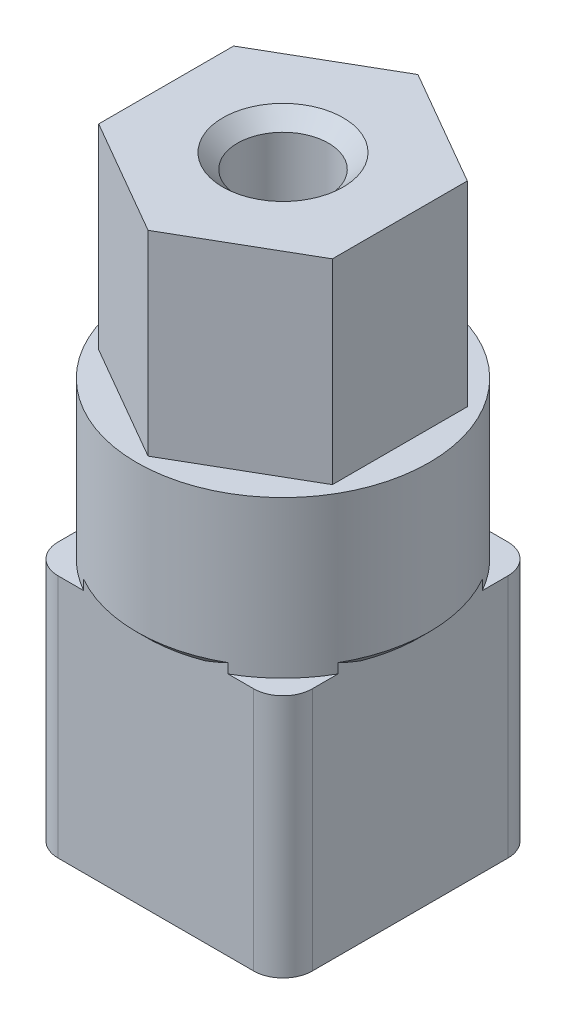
ISO-10303-21;
HEADER;
FILE_DESCRIPTION(('STEP AP214'),'2;1');
FILE_NAME('part.step','',(''),(''),'','','');
FILE_SCHEMA(('AUTOMOTIVE_DESIGN { 1 0 10303 214 1 1 1 1 }'));
ENDSEC;
DATA;
#1=APPLICATION_CONTEXT('core data for automotive mechanical design processes');
#2=APPLICATION_PROTOCOL_DEFINITION('international standard','automotive_design',2000,#1);
#3=PRODUCT_CONTEXT('',#1,'mechanical');
#4=PRODUCT('Part','Part','',(#3));
#5=PRODUCT_RELATED_PRODUCT_CATEGORY('part','',(#4));
#6=PRODUCT_DEFINITION_FORMATION('','',#4);
#7=PRODUCT_DEFINITION_CONTEXT('part definition',#1,'design');
#8=PRODUCT_DEFINITION('design','',#6,#7);
#9=PRODUCT_DEFINITION_SHAPE('','',#8);
#10=(LENGTH_UNIT() NAMED_UNIT(*) SI_UNIT(.MILLI.,.METRE.));
#11=(NAMED_UNIT(*) PLANE_ANGLE_UNIT() SI_UNIT($,.RADIAN.));
#12=(NAMED_UNIT(*) SI_UNIT($,.STERADIAN.) SOLID_ANGLE_UNIT());
#13=UNCERTAINTY_MEASURE_WITH_UNIT(LENGTH_MEASURE(1.E-05),#10,'distance_accuracy_value','');
#14=(GEOMETRIC_REPRESENTATION_CONTEXT(3) GLOBAL_UNCERTAINTY_ASSIGNED_CONTEXT((#13)) GLOBAL_UNIT_ASSIGNED_CONTEXT((#10,
#11,#12)) REPRESENTATION_CONTEXT('',''));
#15=CARTESIAN_POINT('',(0.,0.,0.));
#16=DIRECTION('',(0.,0.,1.));
#17=DIRECTION('',(1.,0.,0.));
#18=AXIS2_PLACEMENT_3D('',#15,#16,#17);
#19=CARTESIAN_POINT('',(0.,41.,0.));
#20=DIRECTION('',(0.,1.,0.));
#21=DIRECTION('',(0.,0.,1.));
#22=AXIS2_PLACEMENT_3D('',#19,#20,#21);
#23=PLANE('',#22);
#24=CARTESIAN_POINT('',(0.,41.,0.));
#25=DIRECTION('',(0.,1.,0.));
#26=DIRECTION('',(0.,0.,1.));
#27=AXIS2_PLACEMENT_3D('',#24,#25,#26);
#28=CIRCLE('',#27,14.95);
#29=CARTESIAN_POINT('',(0.,41.,14.95));
#30=VERTEX_POINT('',#29);
#31=EDGE_CURVE('E250',#30,#30,#28,.T.);
#32=ORIENTED_EDGE('',*,*,#31,.T.);
#33=EDGE_LOOP('',(#32));
#34=FACE_BOUND('',#33,.T.);
#35=DIRECTION('',(-0.866025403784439,0.,0.5));
#36=VECTOR('',#35,1.);
#37=CARTESIAN_POINT('',(0.,41.,-13.7986714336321));
#38=LINE('',#37,#36);
#39=CARTESIAN_POINT('',(0.,41.,-13.7986714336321));
#40=VERTEX_POINT('',#39);
#41=CARTESIAN_POINT('',(-11.95,41.,-6.89933571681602));
#42=VERTEX_POINT('',#41);
#43=EDGE_CURVE('E654',#40,#42,#38,.T.);
#44=ORIENTED_EDGE('',*,*,#43,.F.);
#45=DIRECTION('',(-0.866025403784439,0.,-0.5));
#46=VECTOR('',#45,1.);
#47=CARTESIAN_POINT('',(11.95,41.,-6.89933571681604));
#48=LINE('',#47,#46);
#49=CARTESIAN_POINT('',(11.95,41.,-6.89933571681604));
#50=VERTEX_POINT('',#49);
#51=EDGE_CURVE('E242',#50,#40,#48,.T.);
#52=ORIENTED_EDGE('',*,*,#51,.F.);
#53=DIRECTION('',(0.,0.,-1.));
#54=VECTOR('',#53,1.);
#55=CARTESIAN_POINT('',(11.95,41.,6.89933571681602));
#56=LINE('',#55,#54);
#57=CARTESIAN_POINT('',(11.95,41.,6.89933571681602));
#58=VERTEX_POINT('',#57);
#59=EDGE_CURVE('E238',#58,#50,#56,.T.);
#60=ORIENTED_EDGE('',*,*,#59,.F.);
#61=DIRECTION('',(0.866025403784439,0.,-0.5));
#62=VECTOR('',#61,1.);
#63=CARTESIAN_POINT('',(0.,41.,13.798671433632));
#64=LINE('',#63,#62);
#65=CARTESIAN_POINT('',(0.,41.,13.798671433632));
#66=VERTEX_POINT('',#65);
#67=EDGE_CURVE('E638',#66,#58,#64,.T.);
#68=ORIENTED_EDGE('',*,*,#67,.F.);
#69=DIRECTION('',(0.866025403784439,0.,0.5));
#70=VECTOR('',#69,1.);
#71=CARTESIAN_POINT('',(-11.95,41.,6.89933571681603));
#72=LINE('',#71,#70);
#73=CARTESIAN_POINT('',(-11.95,41.,6.89933571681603));
#74=VERTEX_POINT('',#73);
#75=EDGE_CURVE('E636',#74,#66,#72,.T.);
#76=ORIENTED_EDGE('',*,*,#75,.F.);
#77=DIRECTION('',(0.,0.,1.));
#78=VECTOR('',#77,1.);
#79=CARTESIAN_POINT('',(-11.95,41.,-6.89933571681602));
#80=LINE('',#79,#78);
#81=EDGE_CURVE('E639',#42,#74,#80,.T.);
#82=ORIENTED_EDGE('',*,*,#81,.F.);
#83=EDGE_LOOP('',(#44,#52,#60,#68,#76,#82));
#84=FACE_BOUND('',#83,.T.);
#85=ADVANCED_FACE('F38',(#34,#84),#23,.T.);
#86=CARTESIAN_POINT('',(9.99999999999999,25.,9.99999999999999));
#87=DIRECTION('',(0.,1.,0.));
#88=DIRECTION('',(0.,0.,1.));
#89=AXIS2_PLACEMENT_3D('',#86,#87,#88);
#90=PLANE('',#89);
#91=CARTESIAN_POINT('',(0.,25.,0.));
#92=DIRECTION('',(0.,1.,0.));
#93=DIRECTION('',(0.,0.,1.));
#94=AXIS2_PLACEMENT_3D('',#91,#92,#93);
#95=CIRCLE('',#94,14.95);
#96=CARTESIAN_POINT('',(7.38258084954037,25.,13.));
#97=VERTEX_POINT('',#96);
#98=CARTESIAN_POINT('',(13.,25.,7.38258084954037));
#99=VERTEX_POINT('',#98);
#100=EDGE_CURVE('E245',#97,#99,#95,.T.);
#101=ORIENTED_EDGE('',*,*,#100,.F.);
#102=DIRECTION('',(1.,0.,0.));
#103=VECTOR('',#102,1.);
#104=CARTESIAN_POINT('',(9.99999999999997,25.,13.));
#105=LINE('',#104,#103);
#106=CARTESIAN_POINT('',(9.99999999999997,25.,13.));
#107=VERTEX_POINT('',#106);
#108=EDGE_CURVE('E295',#97,#107,#105,.T.);
#109=ORIENTED_EDGE('',*,*,#108,.T.);
#110=CARTESIAN_POINT('',(9.99999999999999,25.,9.99999999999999));
#111=DIRECTION('',(0.,1.,0.));
#112=DIRECTION('',(0.,0.,1.));
#113=AXIS2_PLACEMENT_3D('',#110,#111,#112);
#114=CIRCLE('',#113,3.);
#115=CARTESIAN_POINT('',(13.,25.,9.99999999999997));
#116=VERTEX_POINT('',#115);
#117=EDGE_CURVE('E263',#107,#116,#114,.T.);
#118=ORIENTED_EDGE('',*,*,#117,.T.);
#119=DIRECTION('',(0.,0.,-1.));
#120=VECTOR('',#119,1.);
#121=CARTESIAN_POINT('',(13.,25.,9.99999999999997));
#122=LINE('',#121,#120);
#123=EDGE_CURVE('E269',#116,#99,#122,.T.);
#124=ORIENTED_EDGE('',*,*,#123,.T.);
#125=EDGE_LOOP('',(#101,#109,#118,#124));
#126=FACE_BOUND('',#125,.T.);
#127=ADVANCED_FACE('F522',(#126),#90,.T.);
#128=CARTESIAN_POINT('',(13.,25.,-7.38258084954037));
#129=VERTEX_POINT('',#128);
#130=CARTESIAN_POINT('',(7.38258084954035,25.,-13.));
#131=VERTEX_POINT('',#130);
#132=EDGE_CURVE('E252',#129,#131,#95,.T.);
#133=ORIENTED_EDGE('',*,*,#132,.F.);
#134=CARTESIAN_POINT('',(13.,25.,-9.99999999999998));
#135=VERTEX_POINT('',#134);
#136=EDGE_CURVE('E267',#129,#135,#122,.T.);
#137=ORIENTED_EDGE('',*,*,#136,.T.);
#138=CARTESIAN_POINT('',(9.99999999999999,25.,-10.));
#139=DIRECTION('',(0.,1.,0.));
#140=DIRECTION('',(0.,0.,1.));
#141=AXIS2_PLACEMENT_3D('',#138,#139,#140);
#142=CIRCLE('',#141,3.);
#143=CARTESIAN_POINT('',(9.99999999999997,25.,-13.));
#144=VERTEX_POINT('',#143);
#145=EDGE_CURVE('E273',#135,#144,#142,.T.);
#146=ORIENTED_EDGE('',*,*,#145,.T.);
#147=DIRECTION('',(-1.,0.,0.));
#148=VECTOR('',#147,1.);
#149=CARTESIAN_POINT('',(9.99999999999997,25.,-13.));
#150=LINE('',#149,#148);
#151=EDGE_CURVE('E278',#144,#131,#150,.T.);
#152=ORIENTED_EDGE('',*,*,#151,.T.);
#153=EDGE_LOOP('',(#133,#137,#146,#152));
#154=FACE_BOUND('',#153,.T.);
#155=ADVANCED_FACE('F528',(#154),#90,.T.);
#156=CARTESIAN_POINT('',(-7.38258084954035,25.,-13.));
#157=VERTEX_POINT('',#156);
#158=CARTESIAN_POINT('',(-13.,25.,-7.38258084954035));
#159=VERTEX_POINT('',#158);
#160=EDGE_CURVE('E608',#157,#159,#95,.T.);
#161=ORIENTED_EDGE('',*,*,#160,.F.);
#162=CARTESIAN_POINT('',(-9.99999999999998,25.,-13.));
#163=VERTEX_POINT('',#162);
#164=EDGE_CURVE('E277',#157,#163,#150,.T.);
#165=ORIENTED_EDGE('',*,*,#164,.T.);
#166=CARTESIAN_POINT('',(-10.,25.,-10.));
#167=DIRECTION('',(0.,1.,0.));
#168=DIRECTION('',(0.,0.,1.));
#169=AXIS2_PLACEMENT_3D('',#166,#167,#168);
#170=CIRCLE('',#169,3.);
#171=CARTESIAN_POINT('',(-13.,25.,-9.99999999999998));
#172=VERTEX_POINT('',#171);
#173=EDGE_CURVE('E282',#163,#172,#170,.T.);
#174=ORIENTED_EDGE('',*,*,#173,.T.);
#175=DIRECTION('',(0.,0.,1.));
#176=VECTOR('',#175,1.);
#177=CARTESIAN_POINT('',(-13.,25.,9.99999999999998));
#178=LINE('',#177,#176);
#179=EDGE_CURVE('E287',#172,#159,#178,.T.);
#180=ORIENTED_EDGE('',*,*,#179,.T.);
#181=EDGE_LOOP('',(#161,#165,#174,#180));
#182=FACE_BOUND('',#181,.T.);
#183=ADVANCED_FACE('F506',(#182),#90,.T.);
#184=CARTESIAN_POINT('',(9.99999999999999,25.,9.99999999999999));
#185=DIRECTION('',(0.,-1.,0.));
#186=DIRECTION('',(0.,0.,-1.));
#187=AXIS2_PLACEMENT_3D('',#184,#185,#186);
#188=CYLINDRICAL_SURFACE('',#187,3.);
#189=CARTESIAN_POINT('',(9.99999999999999,0.,9.99999999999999));
#190=DIRECTION('',(0.,1.,0.));
#191=DIRECTION('',(0.,0.,1.));
#192=AXIS2_PLACEMENT_3D('',#189,#190,#191);
#193=CIRCLE('',#192,3.);
#194=CARTESIAN_POINT('',(9.99999999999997,0.,13.));
#195=VERTEX_POINT('',#194);
#196=CARTESIAN_POINT('',(13.,0.,9.99999999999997));
#197=VERTEX_POINT('',#196);
#198=EDGE_CURVE('E261',#195,#197,#193,.T.);
#199=ORIENTED_EDGE('',*,*,#198,.T.);
#200=DIRECTION('',(0.,-1.,0.));
#201=VECTOR('',#200,1.);
#202=CARTESIAN_POINT('',(13.,25.,9.99999999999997));
#203=LINE('',#202,#201);
#204=EDGE_CURVE('E351',#116,#197,#203,.T.);
#205=ORIENTED_EDGE('',*,*,#204,.F.);
#206=ORIENTED_EDGE('',*,*,#117,.F.);
#207=DIRECTION('',(0.,-1.,0.));
#208=VECTOR('',#207,1.);
#209=CARTESIAN_POINT('',(9.99999999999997,25.,13.));
#210=LINE('',#209,#208);
#211=EDGE_CURVE('E300',#107,#195,#210,.T.);
#212=ORIENTED_EDGE('',*,*,#211,.T.);
#213=EDGE_LOOP('',(#199,#205,#206,#212));
#214=FACE_BOUND('',#213,.T.);
#215=ADVANCED_FACE('F503',(#214),#188,.T.);
#216=CARTESIAN_POINT('',(13.,25.,9.99999999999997));
#217=DIRECTION('',(-1.,0.,0.));
#218=DIRECTION('',(0.,0.,1.));
#219=AXIS2_PLACEMENT_3D('',#216,#217,#218);
#220=PLANE('',#219);
#221=DIRECTION('',(0.,0.,-1.));
#222=VECTOR('',#221,1.);
#223=CARTESIAN_POINT('',(13.,0.,9.99999999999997));
#224=LINE('',#223,#222);
#225=CARTESIAN_POINT('',(13.,0.,-9.99999999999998));
#226=VERTEX_POINT('',#225);
#227=EDGE_CURVE('E305',#197,#226,#224,.T.);
#228=ORIENTED_EDGE('',*,*,#227,.T.);
#229=DIRECTION('',(0.,-1.,0.));
#230=VECTOR('',#229,1.);
#231=CARTESIAN_POINT('',(13.,25.,-9.99999999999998));
#232=LINE('',#231,#230);
#233=EDGE_CURVE('E347',#135,#226,#232,.T.);
#234=ORIENTED_EDGE('',*,*,#233,.F.);
#235=ORIENTED_EDGE('',*,*,#136,.F.);
#236=DIRECTION('',(0.,-1.,0.));
#237=VECTOR('',#236,1.);
#238=CARTESIAN_POINT('',(13.,26.,-7.38258084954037));
#239=LINE('',#238,#237);
#240=CARTESIAN_POINT('',(13.,26.,-7.38258084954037));
#241=VERTEX_POINT('',#240);
#242=EDGE_CURVE('E377',#241,#129,#239,.T.);
#243=ORIENTED_EDGE('',*,*,#242,.F.);
#244=CARTESIAN_POINT('',(13.,26.,-7.38258084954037));
#245=CARTESIAN_POINT('',(13.,25.9066217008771,-7.1934736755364));
#246=CARTESIAN_POINT('',(13.,25.8154092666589,-7.00328340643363));
#247=CARTESIAN_POINT('',(13.,25.6378848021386,-6.62080821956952));
#248=CARTESIAN_POINT('',(13.,25.5515690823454,-6.42852501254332));
#249=CARTESIAN_POINT('',(13.,25.3842553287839,-6.04163013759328));
#250=CARTESIAN_POINT('',(13.,25.3032577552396,-5.84701826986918));
#251=CARTESIAN_POINT('',(13.,25.147093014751,-5.45529957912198));
#252=CARTESIAN_POINT('',(13.,25.0719303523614,-5.25819096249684));
#253=CARTESIAN_POINT('',(13.,25.,-5.05989130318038));
#254=B_SPLINE_CURVE_WITH_KNOTS('',3,(#244,#245,#246,#247,#248,#249,#250,#251,#252,#253),
.UNSPECIFIED.,.F.,.F.,(4,2,2,2,4),(0.,0.632719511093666,1.26495578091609,1.89724669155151,
2.53002097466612),.UNSPECIFIED.);
#255=CARTESIAN_POINT('',(13.,25.,-5.05989130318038));
#256=VERTEX_POINT('',#255);
#257=EDGE_CURVE('E52',#241,#256,#254,.T.);
#258=ORIENTED_EDGE('',*,*,#257,.T.);
#259=CARTESIAN_POINT('',(13.,25.,5.05989130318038));
#260=VERTEX_POINT('',#259);
#261=EDGE_CURVE('E274',#260,#256,#122,.T.);
#262=ORIENTED_EDGE('',*,*,#261,.F.);
#263=CARTESIAN_POINT('',(13.,25.,5.05989130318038));
#264=CARTESIAN_POINT('',(13.,25.0719303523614,5.25819096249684));
#265=CARTESIAN_POINT('',(13.,25.147093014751,5.45529957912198));
#266=CARTESIAN_POINT('',(13.,25.3032577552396,5.84701826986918));
#267=CARTESIAN_POINT('',(13.,25.3842553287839,6.04163013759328));
#268=CARTESIAN_POINT('',(13.,25.5515690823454,6.42852501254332));
#269=CARTESIAN_POINT('',(13.,25.6378848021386,6.62080821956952));
#270=CARTESIAN_POINT('',(13.,25.8154092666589,7.00328340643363));
#271=CARTESIAN_POINT('',(13.,25.9066217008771,7.1934736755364));
#272=CARTESIAN_POINT('',(13.,26.,7.38258084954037));
#273=B_SPLINE_CURVE_WITH_KNOTS('',3,(#263,#264,#265,#266,#267,#268,#269,#270,#271,#272),
.UNSPECIFIED.,.F.,.F.,(4,2,2,2,4),(0.,0.632774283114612,1.26506519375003,1.89730146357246,
2.53002097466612),.UNSPECIFIED.);
#274=CARTESIAN_POINT('',(13.,26.,7.38258084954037));
#275=VERTEX_POINT('',#274);
#276=EDGE_CURVE('E11',#260,#275,#273,.T.);
#277=ORIENTED_EDGE('',*,*,#276,.T.);
#278=DIRECTION('',(0.,-1.,0.));
#279=VECTOR('',#278,1.);
#280=CARTESIAN_POINT('',(13.,25.,7.38258084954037));
#281=LINE('',#280,#279);
#282=EDGE_CURVE('E58',#99,#275,#281,.F.);
#283=ORIENTED_EDGE('',*,*,#282,.F.);
#284=ORIENTED_EDGE('',*,*,#123,.F.);
#285=ORIENTED_EDGE('',*,*,#204,.T.);
#286=EDGE_LOOP('',(#228,#234,#235,#243,#258,#262,#277,#283,#284,#285));
#287=FACE_BOUND('',#286,.T.);
#288=ADVANCED_FACE('F499',(#287),#220,.F.);
#289=CARTESIAN_POINT('',(9.99999999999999,25.,-10.));
#290=DIRECTION('',(0.,-1.,0.));
#291=DIRECTION('',(0.,0.,-1.));
#292=AXIS2_PLACEMENT_3D('',#289,#290,#291);
#293=CYLINDRICAL_SURFACE('',#292,3.);
#294=CARTESIAN_POINT('',(9.99999999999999,0.,-10.));
#295=DIRECTION('',(0.,1.,0.));
#296=DIRECTION('',(0.,0.,1.));
#297=AXIS2_PLACEMENT_3D('',#294,#295,#296);
#298=CIRCLE('',#297,3.);
#299=CARTESIAN_POINT('',(9.99999999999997,0.,-13.));
#300=VERTEX_POINT('',#299);
#301=EDGE_CURVE('E308',#226,#300,#298,.T.);
#302=ORIENTED_EDGE('',*,*,#301,.T.);
#303=DIRECTION('',(0.,-1.,0.));
#304=VECTOR('',#303,1.);
#305=CARTESIAN_POINT('',(9.99999999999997,25.,-13.));
#306=LINE('',#305,#304);
#307=EDGE_CURVE('E343',#144,#300,#306,.T.);
#308=ORIENTED_EDGE('',*,*,#307,.F.);
#309=ORIENTED_EDGE('',*,*,#145,.F.);
#310=ORIENTED_EDGE('',*,*,#233,.T.);
#311=EDGE_LOOP('',(#302,#308,#309,#310));
#312=FACE_BOUND('',#311,.T.);
#313=ADVANCED_FACE('F488',(#312),#293,.T.);
#314=CARTESIAN_POINT('',(9.99999999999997,25.,-13.));
#315=DIRECTION('',(0.,0.,1.));
#316=DIRECTION('',(1.,0.,0.));
#317=AXIS2_PLACEMENT_3D('',#314,#315,#316);
#318=PLANE('',#317);
#319=DIRECTION('',(-1.,0.,0.));
#320=VECTOR('',#319,1.);
#321=CARTESIAN_POINT('',(9.99999999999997,0.,-13.));
#322=LINE('',#321,#320);
#323=CARTESIAN_POINT('',(-9.99999999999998,0.,-13.));
#324=VERTEX_POINT('',#323);
#325=EDGE_CURVE('E311',#300,#324,#322,.T.);
#326=ORIENTED_EDGE('',*,*,#325,.T.);
#327=DIRECTION('',(0.,-1.,0.));
#328=VECTOR('',#327,1.);
#329=CARTESIAN_POINT('',(-9.99999999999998,25.,-13.));
#330=LINE('',#329,#328);
#331=EDGE_CURVE('E339',#163,#324,#330,.T.);
#332=ORIENTED_EDGE('',*,*,#331,.F.);
#333=ORIENTED_EDGE('',*,*,#164,.F.);
#334=DIRECTION('',(0.,-1.,0.));
#335=VECTOR('',#334,1.);
#336=CARTESIAN_POINT('',(-7.38258084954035,26.,-13.));
#337=LINE('',#336,#335);
#338=CARTESIAN_POINT('',(-7.38258084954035,26.,-13.));
#339=VERTEX_POINT('',#338);
#340=EDGE_CURVE('E386',#339,#157,#337,.T.);
#341=ORIENTED_EDGE('',*,*,#340,.F.);
#342=CARTESIAN_POINT('',(-7.38258084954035,26.,-13.));
#343=CARTESIAN_POINT('',(-7.19347367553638,25.9066217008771,-13.));
#344=CARTESIAN_POINT('',(-7.00328340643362,25.8154092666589,-13.));
#345=CARTESIAN_POINT('',(-6.6208082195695,25.6378848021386,-13.));
#346=CARTESIAN_POINT('',(-6.4285250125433,25.5515690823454,-13.));
#347=CARTESIAN_POINT('',(-6.04163013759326,25.3842553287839,-13.));
#348=CARTESIAN_POINT('',(-5.84701826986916,25.3032577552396,-13.));
#349=CARTESIAN_POINT('',(-5.45529957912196,25.147093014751,-13.));
#350=CARTESIAN_POINT('',(-5.25819096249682,25.0719303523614,-13.));
#351=CARTESIAN_POINT('',(-5.05989130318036,25.,-13.));
#352=B_SPLINE_CURVE_WITH_KNOTS('',3,(#342,#343,#344,#345,#346,#347,#348,#349,#350,#351),
.UNSPECIFIED.,.F.,.F.,(4,2,2,2,4),(0.,0.632719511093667,1.26495578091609,1.89724669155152,
2.53002097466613),.UNSPECIFIED.);
#353=CARTESIAN_POINT('',(-5.05989130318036,25.,-13.));
#354=VERTEX_POINT('',#353);
#355=EDGE_CURVE('E468',#339,#354,#352,.T.);
#356=ORIENTED_EDGE('',*,*,#355,.T.);
#357=CARTESIAN_POINT('',(5.05989130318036,25.,-13.));
#358=VERTEX_POINT('',#357);
#359=EDGE_CURVE('E283',#358,#354,#150,.T.);
#360=ORIENTED_EDGE('',*,*,#359,.F.);
#361=CARTESIAN_POINT('',(5.05989130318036,25.,-13.));
#362=CARTESIAN_POINT('',(5.25819096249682,25.0719303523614,-13.));
#363=CARTESIAN_POINT('',(5.45529957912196,25.147093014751,-13.));
#364=CARTESIAN_POINT('',(5.84701826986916,25.3032577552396,-13.));
#365=CARTESIAN_POINT('',(6.04163013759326,25.3842553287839,-13.));
#366=CARTESIAN_POINT('',(6.4285250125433,25.5515690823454,-13.));
#367=CARTESIAN_POINT('',(6.6208082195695,25.6378848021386,-13.));
#368=CARTESIAN_POINT('',(7.00328340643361,25.8154092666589,-13.));
#369=CARTESIAN_POINT('',(7.19347367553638,25.9066217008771,-13.));
#370=CARTESIAN_POINT('',(7.38258084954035,26.,-13.));
#371=B_SPLINE_CURVE_WITH_KNOTS('',3,(#361,#362,#363,#364,#365,#366,#367,#368,#369,#370),
.UNSPECIFIED.,.F.,.F.,(4,2,2,2,4),(0.,0.632774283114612,1.26506519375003,1.89730146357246,
2.53002097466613),.UNSPECIFIED.);
#372=CARTESIAN_POINT('',(7.38258084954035,26.,-13.));
#373=VERTEX_POINT('',#372);
#374=EDGE_CURVE('E490',#358,#373,#371,.T.);
#375=ORIENTED_EDGE('',*,*,#374,.T.);
#376=DIRECTION('',(0.,-1.,0.));
#377=VECTOR('',#376,1.);
#378=CARTESIAN_POINT('',(7.38258084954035,25.,-13.));
#379=LINE('',#378,#377);
#380=EDGE_CURVE('E66',#131,#373,#379,.F.);
#381=ORIENTED_EDGE('',*,*,#380,.F.);
#382=ORIENTED_EDGE('',*,*,#151,.F.);
#383=ORIENTED_EDGE('',*,*,#307,.T.);
#384=EDGE_LOOP('',(#326,#332,#333,#341,#356,#360,#375,#381,#382,#383));
#385=FACE_BOUND('',#384,.T.);
#386=ADVANCED_FACE('F483',(#385),#318,.F.);
#387=CARTESIAN_POINT('',(-10.,25.,-10.));
#388=DIRECTION('',(0.,-1.,0.));
#389=DIRECTION('',(0.,0.,-1.));
#390=AXIS2_PLACEMENT_3D('',#387,#388,#389);
#391=CYLINDRICAL_SURFACE('',#390,3.);
#392=CARTESIAN_POINT('',(-10.,0.,-10.));
#393=DIRECTION('',(0.,1.,0.));
#394=DIRECTION('',(0.,0.,1.));
#395=AXIS2_PLACEMENT_3D('',#392,#393,#394);
#396=CIRCLE('',#395,3.);
#397=CARTESIAN_POINT('',(-13.,0.,-9.99999999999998));
#398=VERTEX_POINT('',#397);
#399=EDGE_CURVE('E314',#324,#398,#396,.T.);
#400=ORIENTED_EDGE('',*,*,#399,.T.);
#401=DIRECTION('',(0.,-1.,0.));
#402=VECTOR('',#401,1.);
#403=CARTESIAN_POINT('',(-13.,25.,-9.99999999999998));
#404=LINE('',#403,#402);
#405=EDGE_CURVE('E335',#172,#398,#404,.T.);
#406=ORIENTED_EDGE('',*,*,#405,.F.);
#407=ORIENTED_EDGE('',*,*,#173,.F.);
#408=ORIENTED_EDGE('',*,*,#331,.T.);
#409=EDGE_LOOP('',(#400,#406,#407,#408));
#410=FACE_BOUND('',#409,.T.);
#411=ADVANCED_FACE('F479',(#410),#391,.T.);
#412=CARTESIAN_POINT('',(-13.,25.,9.99999999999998));
#413=DIRECTION('',(1.,0.,0.));
#414=DIRECTION('',(0.,0.,-1.));
#415=AXIS2_PLACEMENT_3D('',#412,#413,#414);
#416=PLANE('',#415);
#417=DIRECTION('',(0.,0.,1.));
#418=VECTOR('',#417,1.);
#419=CARTESIAN_POINT('',(-13.,0.,9.99999999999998));
#420=LINE('',#419,#418);
#421=CARTESIAN_POINT('',(-13.,0.,9.99999999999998));
#422=VERTEX_POINT('',#421);
#423=EDGE_CURVE('E317',#398,#422,#420,.T.);
#424=ORIENTED_EDGE('',*,*,#423,.T.);
#425=DIRECTION('',(0.,-1.,0.));
#426=VECTOR('',#425,1.);
#427=CARTESIAN_POINT('',(-13.,25.,9.99999999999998));
#428=LINE('',#427,#426);
#429=CARTESIAN_POINT('',(-13.,25.,9.99999999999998));
#430=VERTEX_POINT('',#429);
#431=EDGE_CURVE('E331',#430,#422,#428,.T.);
#432=ORIENTED_EDGE('',*,*,#431,.F.);
#433=CARTESIAN_POINT('',(-13.,25.,7.38258084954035));
#434=VERTEX_POINT('',#433);
#435=EDGE_CURVE('E286',#434,#430,#178,.T.);
#436=ORIENTED_EDGE('',*,*,#435,.F.);
#437=DIRECTION('',(0.,-1.,0.));
#438=VECTOR('',#437,1.);
#439=CARTESIAN_POINT('',(-13.,26.,7.38258084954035));
#440=LINE('',#439,#438);
#441=CARTESIAN_POINT('',(-13.,26.,7.38258084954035));
#442=VERTEX_POINT('',#441);
#443=EDGE_CURVE('E397',#442,#434,#440,.T.);
#444=ORIENTED_EDGE('',*,*,#443,.F.);
#445=CARTESIAN_POINT('',(-13.,26.,7.38258084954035));
#446=CARTESIAN_POINT('',(-13.,25.9066217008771,7.19347367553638));
#447=CARTESIAN_POINT('',(-13.,25.8154092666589,7.00328340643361));
#448=CARTESIAN_POINT('',(-13.,25.6378848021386,6.6208082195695));
#449=CARTESIAN_POINT('',(-13.,25.5515690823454,6.4285250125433));
#450=CARTESIAN_POINT('',(-13.,25.3842553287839,6.04163013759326));
#451=CARTESIAN_POINT('',(-13.,25.3032577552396,5.84701826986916));
#452=CARTESIAN_POINT('',(-13.,25.147093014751,5.45529957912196));
#453=CARTESIAN_POINT('',(-13.,25.0719303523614,5.25819096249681));
#454=CARTESIAN_POINT('',(-13.,25.,5.05989130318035));
#455=B_SPLINE_CURVE_WITH_KNOTS('',3,(#445,#446,#447,#448,#449,#450,#451,#452,#453,#454),
.UNSPECIFIED.,.F.,.F.,(4,2,2,2,4),(0.,0.632719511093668,1.26495578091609,1.89724669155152,
2.53002097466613),.UNSPECIFIED.);
#456=CARTESIAN_POINT('',(-13.,25.,5.05989130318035));
#457=VERTEX_POINT('',#456);
#458=EDGE_CURVE('E456',#442,#457,#455,.T.);
#459=ORIENTED_EDGE('',*,*,#458,.T.);
#460=CARTESIAN_POINT('',(-13.,25.,-5.05989130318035));
#461=VERTEX_POINT('',#460);
#462=EDGE_CURVE('E292',#461,#457,#178,.T.);
#463=ORIENTED_EDGE('',*,*,#462,.F.);
#464=CARTESIAN_POINT('',(-13.,25.,-5.05989130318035));
#465=CARTESIAN_POINT('',(-13.,25.0719303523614,-5.25819096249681));
#466=CARTESIAN_POINT('',(-13.,25.147093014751,-5.45529957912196));
#467=CARTESIAN_POINT('',(-13.,25.3032577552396,-5.84701826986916));
#468=CARTESIAN_POINT('',(-13.,25.3842553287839,-6.04163013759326));
#469=CARTESIAN_POINT('',(-13.,25.5515690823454,-6.4285250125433));
#470=CARTESIAN_POINT('',(-13.,25.6378848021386,-6.6208082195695));
#471=CARTESIAN_POINT('',(-13.,25.8154092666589,-7.00328340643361));
#472=CARTESIAN_POINT('',(-13.,25.9066217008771,-7.19347367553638));
#473=CARTESIAN_POINT('',(-13.,26.,-7.38258084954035));
#474=B_SPLINE_CURVE_WITH_KNOTS('',3,(#464,#465,#466,#467,#468,#469,#470,#471,#472,#473),
.UNSPECIFIED.,.F.,.F.,(4,2,2,2,4),(0.,0.632774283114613,1.26506519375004,1.89730146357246,
2.53002097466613),.UNSPECIFIED.);
#475=CARTESIAN_POINT('',(-13.,26.,-7.38258084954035));
#476=VERTEX_POINT('',#475);
#477=EDGE_CURVE('E462',#461,#476,#474,.T.);
#478=ORIENTED_EDGE('',*,*,#477,.T.);
#479=DIRECTION('',(0.,-1.,0.));
#480=VECTOR('',#479,1.);
#481=CARTESIAN_POINT('',(-13.,25.,-7.38258084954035));
#482=LINE('',#481,#480);
#483=EDGE_CURVE('E389',#159,#476,#482,.F.);
#484=ORIENTED_EDGE('',*,*,#483,.F.);
#485=ORIENTED_EDGE('',*,*,#179,.F.);
#486=ORIENTED_EDGE('',*,*,#405,.T.);
#487=EDGE_LOOP('',(#424,#432,#436,#444,#459,#463,#478,#484,#485,#486));
#488=FACE_BOUND('',#487,.T.);
#489=ADVANCED_FACE('F474',(#488),#416,.F.);
#490=CARTESIAN_POINT('',(-10.,25.,10.));
#491=DIRECTION('',(0.,-1.,0.));
#492=DIRECTION('',(0.,0.,-1.));
#493=AXIS2_PLACEMENT_3D('',#490,#491,#492);
#494=CYLINDRICAL_SURFACE('',#493,3.);
#495=CARTESIAN_POINT('',(-10.,0.,10.));
#496=DIRECTION('',(0.,1.,0.));
#497=DIRECTION('',(0.,0.,-1.));
#498=AXIS2_PLACEMENT_3D('',#495,#496,#497);
#499=CIRCLE('',#498,3.);
#500=CARTESIAN_POINT('',(-9.99999999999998,0.,13.));
#501=VERTEX_POINT('',#500);
#502=EDGE_CURVE('E320',#422,#501,#499,.T.);
#503=ORIENTED_EDGE('',*,*,#502,.T.);
#504=DIRECTION('',(0.,-1.,0.));
#505=VECTOR('',#504,1.);
#506=CARTESIAN_POINT('',(-9.99999999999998,25.,13.));
#507=LINE('',#506,#505);
#508=CARTESIAN_POINT('',(-9.99999999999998,25.,13.));
#509=VERTEX_POINT('',#508);
#510=EDGE_CURVE('E327',#509,#501,#507,.T.);
#511=ORIENTED_EDGE('',*,*,#510,.F.);
#512=CARTESIAN_POINT('',(-10.,25.,10.));
#513=DIRECTION('',(0.,1.,0.));
#514=DIRECTION('',(0.,0.,-1.));
#515=AXIS2_PLACEMENT_3D('',#512,#513,#514);
#516=CIRCLE('',#515,3.);
#517=EDGE_CURVE('E291',#430,#509,#516,.T.);
#518=ORIENTED_EDGE('',*,*,#517,.F.);
#519=ORIENTED_EDGE('',*,*,#431,.T.);
#520=EDGE_LOOP('',(#503,#511,#518,#519));
#521=FACE_BOUND('',#520,.T.);
#522=ADVANCED_FACE('F478',(#521),#494,.T.);
#523=CARTESIAN_POINT('',(9.99999999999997,25.,13.));
#524=DIRECTION('',(0.,0.,-1.));
#525=DIRECTION('',(-1.,0.,0.));
#526=AXIS2_PLACEMENT_3D('',#523,#524,#525);
#527=PLANE('',#526);
#528=DIRECTION('',(1.,0.,0.));
#529=VECTOR('',#528,1.);
#530=CARTESIAN_POINT('',(9.99999999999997,0.,13.));
#531=LINE('',#530,#529);
#532=EDGE_CURVE('E268',#501,#195,#531,.T.);
#533=ORIENTED_EDGE('',*,*,#532,.T.);
#534=ORIENTED_EDGE('',*,*,#211,.F.);
#535=ORIENTED_EDGE('',*,*,#108,.F.);
#536=DIRECTION('',(0.,-1.,0.));
#537=VECTOR('',#536,1.);
#538=CARTESIAN_POINT('',(7.38258084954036,26.,13.));
#539=LINE('',#538,#537);
#540=CARTESIAN_POINT('',(7.38258084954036,26.,13.));
#541=VERTEX_POINT('',#540);
#542=EDGE_CURVE('E408',#541,#97,#539,.T.);
#543=ORIENTED_EDGE('',*,*,#542,.F.);
#544=CARTESIAN_POINT('',(7.38258084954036,26.,13.));
#545=CARTESIAN_POINT('',(7.1934736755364,25.9066217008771,13.));
#546=CARTESIAN_POINT('',(7.00328340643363,25.8154092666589,13.));
#547=CARTESIAN_POINT('',(6.62080821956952,25.6378848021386,13.));
#548=CARTESIAN_POINT('',(6.42852501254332,25.5515690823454,13.));
#549=CARTESIAN_POINT('',(6.04163013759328,25.3842553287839,13.));
#550=CARTESIAN_POINT('',(5.84701826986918,25.3032577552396,13.));
#551=CARTESIAN_POINT('',(5.45529957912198,25.147093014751,13.));
#552=CARTESIAN_POINT('',(5.25819096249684,25.0719303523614,13.));
#553=CARTESIAN_POINT('',(5.05989130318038,25.,13.));
#554=B_SPLINE_CURVE_WITH_KNOTS('',3,(#544,#545,#546,#547,#548,#549,#550,#551,#552,#553),
.UNSPECIFIED.,.F.,.F.,(4,2,2,2,4),(0.,0.632719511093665,1.26495578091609,1.89724669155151,
2.53002097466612),.UNSPECIFIED.);
#555=CARTESIAN_POINT('',(5.05989130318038,25.,13.));
#556=VERTEX_POINT('',#555);
#557=EDGE_CURVE('E423',#541,#556,#554,.T.);
#558=ORIENTED_EDGE('',*,*,#557,.T.);
#559=CARTESIAN_POINT('',(-5.05989130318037,25.,13.));
#560=VERTEX_POINT('',#559);
#561=EDGE_CURVE('E301',#560,#556,#105,.T.);
#562=ORIENTED_EDGE('',*,*,#561,.F.);
#563=CARTESIAN_POINT('',(-5.05989130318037,25.,13.));
#564=CARTESIAN_POINT('',(-5.25819096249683,25.0719303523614,13.));
#565=CARTESIAN_POINT('',(-5.45529957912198,25.147093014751,13.));
#566=CARTESIAN_POINT('',(-5.84701826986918,25.3032577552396,13.));
#567=CARTESIAN_POINT('',(-6.04163013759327,25.3842553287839,13.));
#568=CARTESIAN_POINT('',(-6.42852501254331,25.5515690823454,13.));
#569=CARTESIAN_POINT('',(-6.62080821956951,25.6378848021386,13.));
#570=CARTESIAN_POINT('',(-7.00328340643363,25.8154092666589,13.));
#571=CARTESIAN_POINT('',(-7.19347367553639,25.9066217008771,13.));
#572=CARTESIAN_POINT('',(-7.38258084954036,26.,13.));
#573=B_SPLINE_CURVE_WITH_KNOTS('',3,(#563,#564,#565,#566,#567,#568,#569,#570,#571,#572),
.UNSPECIFIED.,.F.,.F.,(4,2,2,2,4),(0.,0.632774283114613,1.26506519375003,1.89730146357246,
2.53002097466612),.UNSPECIFIED.);
#574=CARTESIAN_POINT('',(-7.38258084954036,26.,13.));
#575=VERTEX_POINT('',#574);
#576=EDGE_CURVE('E431',#560,#575,#573,.T.);
#577=ORIENTED_EDGE('',*,*,#576,.T.);
#578=DIRECTION('',(0.,-1.,0.));
#579=VECTOR('',#578,1.);
#580=CARTESIAN_POINT('',(-7.38258084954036,25.,13.));
#581=LINE('',#580,#579);
#582=CARTESIAN_POINT('',(-7.38258084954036,25.,13.));
#583=VERTEX_POINT('',#582);
#584=EDGE_CURVE('E400',#583,#575,#581,.F.);
#585=ORIENTED_EDGE('',*,*,#584,.F.);
#586=EDGE_CURVE('E296',#509,#583,#105,.T.);
#587=ORIENTED_EDGE('',*,*,#586,.F.);
#588=ORIENTED_EDGE('',*,*,#510,.T.);
#589=EDGE_LOOP('',(#533,#534,#535,#543,#558,#562,#577,#585,#587,#588));
#590=FACE_BOUND('',#589,.T.);
#591=ADVANCED_FACE('F436',(#590),#527,.F.);
#592=EDGE_CURVE('E253',#434,#583,#95,.T.);
#593=ORIENTED_EDGE('',*,*,#592,.F.);
#594=ORIENTED_EDGE('',*,*,#435,.T.);
#595=ORIENTED_EDGE('',*,*,#517,.T.);
#596=ORIENTED_EDGE('',*,*,#586,.T.);
#597=EDGE_LOOP('',(#593,#594,#595,#596));
#598=FACE_BOUND('',#597,.T.);
#599=ADVANCED_FACE('F531',(#598),#90,.T.);
#600=CARTESIAN_POINT('',(9.99999999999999,0.,9.99999999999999));
#601=DIRECTION('',(0.,1.,0.));
#602=DIRECTION('',(0.,0.,1.));
#603=AXIS2_PLACEMENT_3D('',#600,#601,#602);
#604=PLANE('',#603);
#605=CARTESIAN_POINT('',(0.,0.,0.));
#606=DIRECTION('',(0.,1.,0.));
#607=DIRECTION('',(0.,0.,1.));
#608=AXIS2_PLACEMENT_3D('',#605,#606,#607);
#609=CIRCLE('',#608,9.95996839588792);
#610=CARTESIAN_POINT('',(0.,0.,9.95996839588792));
#611=VERTEX_POINT('',#610);
#612=EDGE_CURVE('E363',#611,#611,#609,.T.);
#613=ORIENTED_EDGE('',*,*,#612,.T.);
#614=EDGE_LOOP('',(#613));
#615=FACE_BOUND('',#614,.T.);
#616=ORIENTED_EDGE('',*,*,#198,.F.);
#617=ORIENTED_EDGE('',*,*,#532,.F.);
#618=ORIENTED_EDGE('',*,*,#502,.F.);
#619=ORIENTED_EDGE('',*,*,#423,.F.);
#620=ORIENTED_EDGE('',*,*,#399,.F.);
#621=ORIENTED_EDGE('',*,*,#325,.F.);
#622=ORIENTED_EDGE('',*,*,#301,.F.);
#623=ORIENTED_EDGE('',*,*,#227,.F.);
#624=EDGE_LOOP('',(#616,#617,#618,#619,#620,#621,#622,#623));
#625=FACE_BOUND('',#624,.T.);
#626=ADVANCED_FACE('F540',(#615,#625),#604,.F.);
#627=CARTESIAN_POINT('',(0.,25.,0.));
#628=DIRECTION('',(0.,1.,0.));
#629=DIRECTION('',(0.,0.,1.));
#630=AXIS2_PLACEMENT_3D('',#627,#628,#629);
#631=PLANE('',#630);
#632=ORIENTED_EDGE('',*,*,#261,.T.);
#633=CARTESIAN_POINT('',(0.,25.,0.));
#634=DIRECTION('',(0.,1.,0.));
#635=DIRECTION('',(0.,0.,1.));
#636=AXIS2_PLACEMENT_3D('',#633,#634,#635);
#637=CIRCLE('',#636,13.95);
#638=EDGE_CURVE('E420',#256,#260,#637,.F.);
#639=ORIENTED_EDGE('',*,*,#638,.T.);
#640=EDGE_LOOP('',(#632,#639));
#641=FACE_BOUND('',#640,.T.);
#642=ADVANCED_FACE('F536',(#641),#631,.F.);
#643=ORIENTED_EDGE('',*,*,#359,.T.);
#644=CARTESIAN_POINT('',(0.,25.,0.));
#645=DIRECTION('',(0.,1.,0.));
#646=DIRECTION('',(0.,0.,1.));
#647=AXIS2_PLACEMENT_3D('',#644,#645,#646);
#648=CIRCLE('',#647,13.95);
#649=EDGE_CURVE('E417',#354,#358,#648,.F.);
#650=ORIENTED_EDGE('',*,*,#649,.T.);
#651=EDGE_LOOP('',(#643,#650));
#652=FACE_BOUND('',#651,.T.);
#653=ADVANCED_FACE('F539',(#652),#631,.F.);
#654=ORIENTED_EDGE('',*,*,#462,.T.);
#655=CARTESIAN_POINT('',(0.,25.,0.));
#656=DIRECTION('',(0.,1.,0.));
#657=DIRECTION('',(0.,0.,1.));
#658=AXIS2_PLACEMENT_3D('',#655,#656,#657);
#659=CIRCLE('',#658,13.95);
#660=EDGE_CURVE('E414',#457,#461,#659,.F.);
#661=ORIENTED_EDGE('',*,*,#660,.T.);
#662=EDGE_LOOP('',(#654,#661));
#663=FACE_BOUND('',#662,.T.);
#664=ADVANCED_FACE('F603',(#663),#631,.F.);
#665=ORIENTED_EDGE('',*,*,#561,.T.);
#666=CARTESIAN_POINT('',(0.,25.,0.));
#667=DIRECTION('',(0.,1.,0.));
#668=DIRECTION('',(0.,0.,1.));
#669=AXIS2_PLACEMENT_3D('',#666,#667,#668);
#670=CIRCLE('',#669,13.95);
#671=EDGE_CURVE('E411',#556,#560,#670,.F.);
#672=ORIENTED_EDGE('',*,*,#671,.T.);
#673=EDGE_LOOP('',(#665,#672));
#674=FACE_BOUND('',#673,.T.);
#675=ADVANCED_FACE('F542',(#674),#631,.F.);
#676=CARTESIAN_POINT('',(0.,41.,0.));
#677=DIRECTION('',(0.,-1.,0.));
#678=DIRECTION('',(0.,0.,-1.));
#679=AXIS2_PLACEMENT_3D('',#676,#677,#678);
#680=CYLINDRICAL_SURFACE('',#679,14.95);
#681=ORIENTED_EDGE('',*,*,#31,.F.);
#682=EDGE_LOOP('',(#681));
#683=FACE_BOUND('',#682,.T.);
#684=CARTESIAN_POINT('',(0.,26.,0.));
#685=DIRECTION('',(0.,1.,0.));
#686=DIRECTION('',(0.,0.,1.));
#687=AXIS2_PLACEMENT_3D('',#684,#685,#686);
#688=CIRCLE('',#687,14.95);
#689=EDGE_CURVE('E404',#575,#541,#688,.T.);
#690=ORIENTED_EDGE('',*,*,#689,.T.);
#691=ORIENTED_EDGE('',*,*,#542,.T.);
#692=ORIENTED_EDGE('',*,*,#100,.T.);
#693=ORIENTED_EDGE('',*,*,#282,.T.);
#694=CARTESIAN_POINT('',(0.,26.,0.));
#695=DIRECTION('',(0.,1.,0.));
#696=DIRECTION('',(0.,0.,1.));
#697=AXIS2_PLACEMENT_3D('',#694,#695,#696);
#698=CIRCLE('',#697,14.95);
#699=EDGE_CURVE('E373',#275,#241,#698,.T.);
#700=ORIENTED_EDGE('',*,*,#699,.T.);
#701=ORIENTED_EDGE('',*,*,#242,.T.);
#702=ORIENTED_EDGE('',*,*,#132,.T.);
#703=ORIENTED_EDGE('',*,*,#380,.T.);
#704=CARTESIAN_POINT('',(0.,26.,0.));
#705=DIRECTION('',(0.,1.,0.));
#706=DIRECTION('',(0.,0.,1.));
#707=AXIS2_PLACEMENT_3D('',#704,#705,#706);
#708=CIRCLE('',#707,14.95);
#709=EDGE_CURVE('E382',#373,#339,#708,.T.);
#710=ORIENTED_EDGE('',*,*,#709,.T.);
#711=ORIENTED_EDGE('',*,*,#340,.T.);
#712=ORIENTED_EDGE('',*,*,#160,.T.);
#713=ORIENTED_EDGE('',*,*,#483,.T.);
#714=CARTESIAN_POINT('',(0.,26.,0.));
#715=DIRECTION('',(0.,1.,0.));
#716=DIRECTION('',(0.,0.,1.));
#717=AXIS2_PLACEMENT_3D('',#714,#715,#716);
#718=CIRCLE('',#717,14.95);
#719=EDGE_CURVE('E393',#476,#442,#718,.T.);
#720=ORIENTED_EDGE('',*,*,#719,.T.);
#721=ORIENTED_EDGE('',*,*,#443,.T.);
#722=ORIENTED_EDGE('',*,*,#592,.T.);
#723=ORIENTED_EDGE('',*,*,#584,.T.);
#724=EDGE_LOOP('',(#690,#691,#692,#693,#700,#701,#702,#703,#710,#711,#712,#713,#720,#721,#722,#723));
#725=FACE_BOUND('',#724,.T.);
#726=ADVANCED_FACE('F543',(#683,#725),#680,.T.);
#727=CARTESIAN_POINT('',(11.95,61.,-6.89933571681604));
#728=DIRECTION('',(-0.5,0.,0.866025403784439));
#729=DIRECTION('',(0.866025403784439,0.,0.5));
#730=AXIS2_PLACEMENT_3D('',#727,#728,#729);
#731=PLANE('',#730);
#732=ORIENTED_EDGE('',*,*,#51,.T.);
#733=DIRECTION('',(0.,-1.,0.));
#734=VECTOR('',#733,1.);
#735=CARTESIAN_POINT('',(0.,61.,-13.7986714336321));
#736=LINE('',#735,#734);
#737=CARTESIAN_POINT('',(0.,61.,-13.7986714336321));
#738=VERTEX_POINT('',#737);
#739=EDGE_CURVE('E220',#738,#40,#736,.T.);
#740=ORIENTED_EDGE('',*,*,#739,.F.);
#741=DIRECTION('',(-0.866025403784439,0.,-0.5));
#742=VECTOR('',#741,1.);
#743=CARTESIAN_POINT('',(11.95,61.,-6.89933571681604));
#744=LINE('',#743,#742);
#745=CARTESIAN_POINT('',(11.95,61.,-6.89933571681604));
#746=VERTEX_POINT('',#745);
#747=EDGE_CURVE('E228',#746,#738,#744,.T.);
#748=ORIENTED_EDGE('',*,*,#747,.F.);
#749=DIRECTION('',(0.,-1.,0.));
#750=VECTOR('',#749,1.);
#751=CARTESIAN_POINT('',(11.95,61.,-6.89933571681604));
#752=LINE('',#751,#750);
#753=EDGE_CURVE('E651',#746,#50,#752,.T.);
#754=ORIENTED_EDGE('',*,*,#753,.T.);
#755=EDGE_LOOP('',(#732,#740,#748,#754));
#756=FACE_BOUND('',#755,.T.);
#757=ADVANCED_FACE('F240',(#756),#731,.F.);
#758=CARTESIAN_POINT('',(0.,61.,-13.7986714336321));
#759=DIRECTION('',(0.5,0.,0.866025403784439));
#760=DIRECTION('',(0.866025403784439,0.,-0.5));
#761=AXIS2_PLACEMENT_3D('',#758,#759,#760);
#762=PLANE('',#761);
#763=ORIENTED_EDGE('',*,*,#43,.T.);
#764=DIRECTION('',(0.,-1.,0.));
#765=VECTOR('',#764,1.);
#766=CARTESIAN_POINT('',(-11.95,61.,-6.89933571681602));
#767=LINE('',#766,#765);
#768=CARTESIAN_POINT('',(-11.95,61.,-6.89933571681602));
#769=VERTEX_POINT('',#768);
#770=EDGE_CURVE('E223',#769,#42,#767,.T.);
#771=ORIENTED_EDGE('',*,*,#770,.F.);
#772=DIRECTION('',(-0.866025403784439,0.,0.5));
#773=VECTOR('',#772,1.);
#774=CARTESIAN_POINT('',(0.,61.,-13.7986714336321));
#775=LINE('',#774,#773);
#776=EDGE_CURVE('E216',#738,#769,#775,.T.);
#777=ORIENTED_EDGE('',*,*,#776,.F.);
#778=ORIENTED_EDGE('',*,*,#739,.T.);
#779=EDGE_LOOP('',(#763,#771,#777,#778));
#780=FACE_BOUND('',#779,.T.);
#781=ADVANCED_FACE('F218',(#780),#762,.F.);
#782=CARTESIAN_POINT('',(-11.95,61.,-6.89933571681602));
#783=DIRECTION('',(1.,0.,0.));
#784=DIRECTION('',(0.,0.,-1.));
#785=AXIS2_PLACEMENT_3D('',#782,#783,#784);
#786=PLANE('',#785);
#787=ORIENTED_EDGE('',*,*,#81,.T.);
#788=DIRECTION('',(0.,-1.,0.));
#789=VECTOR('',#788,1.);
#790=CARTESIAN_POINT('',(-11.95,61.,6.89933571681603));
#791=LINE('',#790,#789);
#792=CARTESIAN_POINT('',(-11.95,61.,6.89933571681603));
#793=VERTEX_POINT('',#792);
#794=EDGE_CURVE('E255',#793,#74,#791,.T.);
#795=ORIENTED_EDGE('',*,*,#794,.F.);
#796=DIRECTION('',(0.,0.,1.));
#797=VECTOR('',#796,1.);
#798=CARTESIAN_POINT('',(-11.95,61.,-6.89933571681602));
#799=LINE('',#798,#797);
#800=EDGE_CURVE('E227',#769,#793,#799,.T.);
#801=ORIENTED_EDGE('',*,*,#800,.F.);
#802=ORIENTED_EDGE('',*,*,#770,.T.);
#803=EDGE_LOOP('',(#787,#795,#801,#802));
#804=FACE_BOUND('',#803,.T.);
#805=ADVANCED_FACE('F689',(#804),#786,.F.);
#806=CARTESIAN_POINT('',(-11.95,61.,6.89933571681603));
#807=DIRECTION('',(0.5,0.,-0.866025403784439));
#808=DIRECTION('',(-0.866025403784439,0.,-0.5));
#809=AXIS2_PLACEMENT_3D('',#806,#807,#808);
#810=PLANE('',#809);
#811=ORIENTED_EDGE('',*,*,#75,.T.);
#812=DIRECTION('',(0.,-1.,0.));
#813=VECTOR('',#812,1.);
#814=CARTESIAN_POINT('',(0.,61.,13.798671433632));
#815=LINE('',#814,#813);
#816=CARTESIAN_POINT('',(0.,61.,13.798671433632));
#817=VERTEX_POINT('',#816);
#818=EDGE_CURVE('E669',#817,#66,#815,.T.);
#819=ORIENTED_EDGE('',*,*,#818,.F.);
#820=DIRECTION('',(0.866025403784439,0.,0.5));
#821=VECTOR('',#820,1.);
#822=CARTESIAN_POINT('',(-11.95,61.,6.89933571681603));
#823=LINE('',#822,#821);
#824=EDGE_CURVE('E641',#793,#817,#823,.T.);
#825=ORIENTED_EDGE('',*,*,#824,.F.);
#826=ORIENTED_EDGE('',*,*,#794,.T.);
#827=EDGE_LOOP('',(#811,#819,#825,#826));
#828=FACE_BOUND('',#827,.T.);
#829=ADVANCED_FACE('F677',(#828),#810,.F.);
#830=CARTESIAN_POINT('',(0.,61.,13.798671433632));
#831=DIRECTION('',(-0.5,0.,-0.866025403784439));
#832=DIRECTION('',(-0.866025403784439,0.,0.5));
#833=AXIS2_PLACEMENT_3D('',#830,#831,#832);
#834=PLANE('',#833);
#835=ORIENTED_EDGE('',*,*,#67,.T.);
#836=DIRECTION('',(0.,-1.,0.));
#837=VECTOR('',#836,1.);
#838=CARTESIAN_POINT('',(11.95,61.,6.89933571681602));
#839=LINE('',#838,#837);
#840=CARTESIAN_POINT('',(11.95,61.,6.89933571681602));
#841=VERTEX_POINT('',#840);
#842=EDGE_CURVE('E666',#841,#58,#839,.T.);
#843=ORIENTED_EDGE('',*,*,#842,.F.);
#844=DIRECTION('',(0.866025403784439,0.,-0.5));
#845=VECTOR('',#844,1.);
#846=CARTESIAN_POINT('',(0.,61.,13.798671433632));
#847=LINE('',#846,#845);
#848=EDGE_CURVE('E644',#817,#841,#847,.T.);
#849=ORIENTED_EDGE('',*,*,#848,.F.);
#850=ORIENTED_EDGE('',*,*,#818,.T.);
#851=EDGE_LOOP('',(#835,#843,#849,#850));
#852=FACE_BOUND('',#851,.T.);
#853=ADVANCED_FACE('F685',(#852),#834,.F.);
#854=CARTESIAN_POINT('',(11.95,61.,6.89933571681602));
#855=DIRECTION('',(-1.,0.,0.));
#856=DIRECTION('',(0.,0.,1.));
#857=AXIS2_PLACEMENT_3D('',#854,#855,#856);
#858=PLANE('',#857);
#859=ORIENTED_EDGE('',*,*,#59,.T.);
#860=ORIENTED_EDGE('',*,*,#753,.F.);
#861=DIRECTION('',(0.,0.,-1.));
#862=VECTOR('',#861,1.);
#863=CARTESIAN_POINT('',(11.95,61.,6.89933571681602));
#864=LINE('',#863,#862);
#865=EDGE_CURVE('E233',#841,#746,#864,.T.);
#866=ORIENTED_EDGE('',*,*,#865,.F.);
#867=ORIENTED_EDGE('',*,*,#842,.T.);
#868=EDGE_LOOP('',(#859,#860,#866,#867));
#869=FACE_BOUND('',#868,.T.);
#870=ADVANCED_FACE('F688',(#869),#858,.F.);
#871=CARTESIAN_POINT('',(0.,61.,0.));
#872=DIRECTION('',(0.,1.,0.));
#873=DIRECTION('',(0.,0.,1.));
#874=AXIS2_PLACEMENT_3D('',#871,#872,#873);
#875=PLANE('',#874);
#876=CARTESIAN_POINT('',(0.,61.,0.));
#877=DIRECTION('',(0.,1.,0.));
#878=DIRECTION('',(0.,0.,1.));
#879=AXIS2_PLACEMENT_3D('',#876,#877,#878);
#880=CIRCLE('',#879,6.15000000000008);
#881=CARTESIAN_POINT('',(0.,61.,6.15000000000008));
#882=VERTEX_POINT('',#881);
#883=EDGE_CURVE('E359',#882,#882,#880,.F.);
#884=ORIENTED_EDGE('',*,*,#883,.T.);
#885=EDGE_LOOP('',(#884));
#886=FACE_BOUND('',#885,.T.);
#887=ORIENTED_EDGE('',*,*,#747,.T.);
#888=ORIENTED_EDGE('',*,*,#776,.T.);
#889=ORIENTED_EDGE('',*,*,#800,.T.);
#890=ORIENTED_EDGE('',*,*,#824,.T.);
#891=ORIENTED_EDGE('',*,*,#848,.T.);
#892=ORIENTED_EDGE('',*,*,#865,.T.);
#893=EDGE_LOOP('',(#887,#888,#889,#890,#891,#892));
#894=FACE_BOUND('',#893,.T.);
#895=ADVANCED_FACE('F231',(#886,#894),#875,.T.);
#896=CARTESIAN_POINT('',(0.,0.,0.));
#897=DIRECTION('',(0.,1.,0.));
#898=DIRECTION('',(0.,0.,1.));
#899=AXIS2_PLACEMENT_3D('',#896,#897,#898);
#900=CYLINDRICAL_SURFACE('',#899,4.65);
#901=CARTESIAN_POINT('',(0.,23.0000000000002,0.));
#902=DIRECTION('',(0.,1.,0.));
#903=DIRECTION('',(0.,0.,1.));
#904=AXIS2_PLACEMENT_3D('',#901,#902,#903);
#905=CIRCLE('',#904,4.65);
#906=CARTESIAN_POINT('',(0.,23.0000000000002,4.65));
#907=VERTEX_POINT('',#906);
#908=EDGE_CURVE('E367',#907,#907,#905,.F.);
#909=CARTESIAN_POINT('',(0.,59.4999999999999,0.));
#910=DIRECTION('',(0.,1.,0.));
#911=DIRECTION('',(0.,0.,1.));
#912=AXIS2_PLACEMENT_3D('',#909,#910,#911);
#913=CIRCLE('',#912,4.65);
#914=CARTESIAN_POINT('',(0.,59.4999999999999,4.65));
#915=VERTEX_POINT('',#914);
#916=EDGE_CURVE('E355',#915,#915,#913,.T.);
#917=CARTESIAN_POINT('',(0.,23.0000000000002,4.65));
#918=CARTESIAN_POINT('',(0.,23.3802083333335,4.65));
#919=CARTESIAN_POINT('',(0.,23.7604166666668,4.65));
#920=CARTESIAN_POINT('',(0.,24.5208333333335,4.65));
#921=CARTESIAN_POINT('',(0.,24.9010416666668,4.65));
#922=CARTESIAN_POINT('',(0.,25.6614583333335,4.65));
#923=CARTESIAN_POINT('',(0.,26.0416666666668,4.65));
#924=CARTESIAN_POINT('',(0.,26.8020833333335,4.65));
#925=CARTESIAN_POINT('',(0.,27.1822916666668,4.65));
#926=CARTESIAN_POINT('',(0.,27.9427083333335,4.65));
#927=CARTESIAN_POINT('',(0.,28.3229166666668,4.65));
#928=CARTESIAN_POINT('',(0.,29.0833333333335,4.65));
#929=CARTESIAN_POINT('',(0.,29.4635416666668,4.65));
#930=CARTESIAN_POINT('',(0.,30.2239583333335,4.65));
#931=CARTESIAN_POINT('',(0.,30.6041666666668,4.65));
#932=CARTESIAN_POINT('',(0.,31.3645833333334,4.65));
#933=CARTESIAN_POINT('',(0.,31.7447916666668,4.65));
#934=CARTESIAN_POINT('',(0.,32.5052083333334,4.65));
#935=CARTESIAN_POINT('',(0.,32.8854166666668,4.65));
#936=CARTESIAN_POINT('',(0.,33.6458333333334,4.65));
#937=CARTESIAN_POINT('',(0.,34.0260416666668,4.65));
#938=CARTESIAN_POINT('',(0.,34.7864583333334,4.65));
#939=CARTESIAN_POINT('',(0.,35.1666666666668,4.65));
#940=CARTESIAN_POINT('',(0.,35.9270833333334,4.65));
#941=CARTESIAN_POINT('',(0.,36.3072916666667,4.65));
#942=CARTESIAN_POINT('',(0.,37.0677083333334,4.65));
#943=CARTESIAN_POINT('',(0.,37.4479166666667,4.65));
#944=CARTESIAN_POINT('',(0.,38.2083333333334,4.65));
#945=CARTESIAN_POINT('',(0.,38.5885416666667,4.65));
#946=CARTESIAN_POINT('',(0.,39.3489583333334,4.65));
#947=CARTESIAN_POINT('',(0.,39.7291666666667,4.65));
#948=CARTESIAN_POINT('',(0.,40.4895833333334,4.65));
#949=CARTESIAN_POINT('',(0.,40.8697916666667,4.65));
#950=CARTESIAN_POINT('',(0.,41.6302083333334,4.65));
#951=CARTESIAN_POINT('',(0.,42.0104166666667,4.65));
#952=CARTESIAN_POINT('',(0.,42.7708333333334,4.65));
#953=CARTESIAN_POINT('',(0.,43.1510416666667,4.65));
#954=CARTESIAN_POINT('',(0.,43.9114583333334,4.65));
#955=CARTESIAN_POINT('',(0.,44.2916666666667,4.65));
#956=CARTESIAN_POINT('',(0.,45.0520833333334,4.65));
#957=CARTESIAN_POINT('',(0.,45.4322916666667,4.65));
#958=CARTESIAN_POINT('',(0.,46.1927083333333,4.65));
#959=CARTESIAN_POINT('',(0.,46.5729166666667,4.65));
#960=CARTESIAN_POINT('',(0.,47.3333333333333,4.65));
#961=CARTESIAN_POINT('',(0.,47.7135416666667,4.65));
#962=CARTESIAN_POINT('',(0.,48.4739583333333,4.65));
#963=CARTESIAN_POINT('',(0.,48.8541666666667,4.65));
#964=CARTESIAN_POINT('',(0.,49.6145833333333,4.65));
#965=CARTESIAN_POINT('',(0.,49.9947916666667,4.65));
#966=CARTESIAN_POINT('',(0.,50.7552083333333,4.65));
#967=CARTESIAN_POINT('',(0.,51.1354166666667,4.65));
#968=CARTESIAN_POINT('',(0.,51.8958333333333,4.65));
#969=CARTESIAN_POINT('',(0.,52.2760416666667,4.65));
#970=CARTESIAN_POINT('',(0.,53.0364583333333,4.65));
#971=CARTESIAN_POINT('',(0.,53.4166666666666,4.65));
#972=CARTESIAN_POINT('',(0.,54.1770833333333,4.65));
#973=CARTESIAN_POINT('',(0.,54.5572916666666,4.65));
#974=CARTESIAN_POINT('',(0.,55.3177083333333,4.65));
#975=CARTESIAN_POINT('',(0.,55.6979166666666,4.65));
#976=CARTESIAN_POINT('',(0.,56.4583333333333,4.65));
#977=CARTESIAN_POINT('',(0.,56.8385416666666,4.65));
#978=CARTESIAN_POINT('',(0.,57.5989583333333,4.65));
#979=CARTESIAN_POINT('',(0.,57.9791666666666,4.65));
#980=CARTESIAN_POINT('',(0.,58.7395833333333,4.65));
#981=CARTESIAN_POINT('',(0.,59.1197916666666,4.65));
#982=CARTESIAN_POINT('',(0.,59.4999999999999,4.65));
#983=B_SPLINE_CURVE_WITH_KNOTS('',3,(#917,#918,#919,#920,#921,#922,#923,#924,#925,#926,#927,
#928,#929,#930,#931,#932,#933,#934,#935,#936,#937,#938,#939,#940,#941,#942,#943,#944,#945,#946,
#947,#948,#949,#950,#951,#952,#953,#954,#955,#956,#957,#958,#959,#960,#961,#962,#963,#964,#965,
#966,#967,#968,#969,#970,#971,#972,#973,#974,#975,#976,#977,#978,#979,#980,#981,#982),
.UNSPECIFIED.,.F.,.F.,(4,2,2,2,2,2,2,2,2,2,2,2,2,2,2,2,2,2,2,2,2,2,2,2,2,2,2,2,2,2,2,2,4),(0.,
1.14062499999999,2.28124999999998,3.42187499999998,4.56249999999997,5.70312499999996,
6.84374999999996,7.98437499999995,9.12499999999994,10.2656249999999,11.4062499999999,
12.5468749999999,13.6874999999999,14.8281249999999,15.9687499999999,17.1093749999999,
18.2499999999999,19.3906249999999,20.5312499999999,21.6718749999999,22.8124999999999,
23.9531249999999,25.0937499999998,26.2343749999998,27.3749999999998,28.5156249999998,
29.6562499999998,30.7968749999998,31.9374999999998,33.0781249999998,34.2187499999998,
35.3593749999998,36.4999999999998),.UNSPECIFIED.);
#984=EDGE_CURVE('BSEAM510',#907,#915,#983,.T.);
#985=ORIENTED_EDGE('',*,*,#908,.T.);
#986=ORIENTED_EDGE('',*,*,#916,.T.);
#987=ORIENTED_EDGE('',*,*,#984,.T.);
#988=ORIENTED_EDGE('',*,*,#984,.F.);
#989=EDGE_LOOP('',(#985,#987,#986,#988));
#990=FACE_BOUND('',#989,.T.);
#991=ADVANCED_FACE('F510',(#990),#900,.F.);
#992=CARTESIAN_POINT('',(0.,59.4999999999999,0.));
#993=DIRECTION('',(0.,1.,0.));
#994=DIRECTION('',(0.,0.,1.));
#995=AXIS2_PLACEMENT_3D('',#992,#993,#994);
#996=CONICAL_SURFACE('',#995,4.65,0.785398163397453);
#997=ORIENTED_EDGE('',*,*,#883,.F.);
#998=EDGE_LOOP('',(#997));
#999=FACE_BOUND('',#998,.T.);
#1000=ORIENTED_EDGE('',*,*,#916,.F.);
#1001=EDGE_LOOP('',(#1000));
#1002=FACE_BOUND('',#1001,.T.);
#1003=ADVANCED_FACE('F508',(#999,#1002),#996,.F.);
#1004=CARTESIAN_POINT('',(0.,0.,0.));
#1005=DIRECTION('',(0.,-1.,0.));
#1006=DIRECTION('',(0.,0.,-1.));
#1007=AXIS2_PLACEMENT_3D('',#1004,#1005,#1006);
#1008=CONICAL_SURFACE('',#1007,9.95996839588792,0.22689280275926);
#1009=ORIENTED_EDGE('',*,*,#908,.F.);
#1010=EDGE_LOOP('',(#1009));
#1011=FACE_BOUND('',#1010,.T.);
#1012=ORIENTED_EDGE('',*,*,#612,.F.);
#1013=EDGE_LOOP('',(#1012));
#1014=FACE_BOUND('',#1013,.T.);
#1015=ADVANCED_FACE('F446',(#1011,#1014),#1008,.F.);
#1016=CARTESIAN_POINT('',(0.,26.,0.));
#1017=DIRECTION('',(0.,1.,0.));
#1018=DIRECTION('',(0.,0.,1.));
#1019=AXIS2_PLACEMENT_3D('',#1016,#1017,#1018);
#1020=CONICAL_SURFACE('',#1019,14.95,0.785398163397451);
#1021=ORIENTED_EDGE('',*,*,#576,.F.);
#1022=ORIENTED_EDGE('',*,*,#671,.F.);
#1023=ORIENTED_EDGE('',*,*,#557,.F.);
#1024=ORIENTED_EDGE('',*,*,#689,.F.);
#1025=EDGE_LOOP('',(#1021,#1022,#1023,#1024));
#1026=FACE_BOUND('',#1025,.T.);
#1027=ADVANCED_FACE('F440',(#1026),#1020,.T.);
#1028=CARTESIAN_POINT('',(0.,26.,0.));
#1029=DIRECTION('',(0.,1.,0.));
#1030=DIRECTION('',(0.,0.,1.));
#1031=AXIS2_PLACEMENT_3D('',#1028,#1029,#1030);
#1032=CONICAL_SURFACE('',#1031,14.95,0.785398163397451);
#1033=ORIENTED_EDGE('',*,*,#477,.F.);
#1034=ORIENTED_EDGE('',*,*,#660,.F.);
#1035=ORIENTED_EDGE('',*,*,#458,.F.);
#1036=ORIENTED_EDGE('',*,*,#719,.F.);
#1037=EDGE_LOOP('',(#1033,#1034,#1035,#1036));
#1038=FACE_BOUND('',#1037,.T.);
#1039=ADVANCED_FACE('F445',(#1038),#1032,.T.);
#1040=CARTESIAN_POINT('',(0.,26.,0.));
#1041=DIRECTION('',(0.,1.,0.));
#1042=DIRECTION('',(0.,0.,1.));
#1043=AXIS2_PLACEMENT_3D('',#1040,#1041,#1042);
#1044=CONICAL_SURFACE('',#1043,14.95,0.785398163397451);
#1045=ORIENTED_EDGE('',*,*,#374,.F.);
#1046=ORIENTED_EDGE('',*,*,#649,.F.);
#1047=ORIENTED_EDGE('',*,*,#355,.F.);
#1048=ORIENTED_EDGE('',*,*,#709,.F.);
#1049=EDGE_LOOP('',(#1045,#1046,#1047,#1048));
#1050=FACE_BOUND('',#1049,.T.);
#1051=ADVANCED_FACE('F452',(#1050),#1044,.T.);
#1052=CARTESIAN_POINT('',(0.,26.,0.));
#1053=DIRECTION('',(0.,1.,0.));
#1054=DIRECTION('',(0.,0.,1.));
#1055=AXIS2_PLACEMENT_3D('',#1052,#1053,#1054);
#1056=CONICAL_SURFACE('',#1055,14.95,0.785398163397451);
#1057=ORIENTED_EDGE('',*,*,#276,.F.);
#1058=ORIENTED_EDGE('',*,*,#638,.F.);
#1059=ORIENTED_EDGE('',*,*,#257,.F.);
#1060=ORIENTED_EDGE('',*,*,#699,.F.);
#1061=EDGE_LOOP('',(#1057,#1058,#1059,#1060));
#1062=FACE_BOUND('',#1061,.T.);
#1063=ADVANCED_FACE('F40',(#1062),#1056,.T.);
#1064=CLOSED_SHELL('',(#85,#127,#155,#183,#215,#288,#313,#386,#411,#489,#522,#591,#599,#626,
#642,#653,#664,#675,#726,#757,#781,#805,#829,#853,#870,#895,#991,#1003,#1015,#1027,#1039,#1051,#1063));
#1065=MANIFOLD_SOLID_BREP('B2',#1064);
#1066=ADVANCED_BREP_SHAPE_REPRESENTATION('',(#18,#1065),#14);
#1067=SHAPE_DEFINITION_REPRESENTATION(#9,#1066);
ENDSEC;
END-ISO-10303-21;
